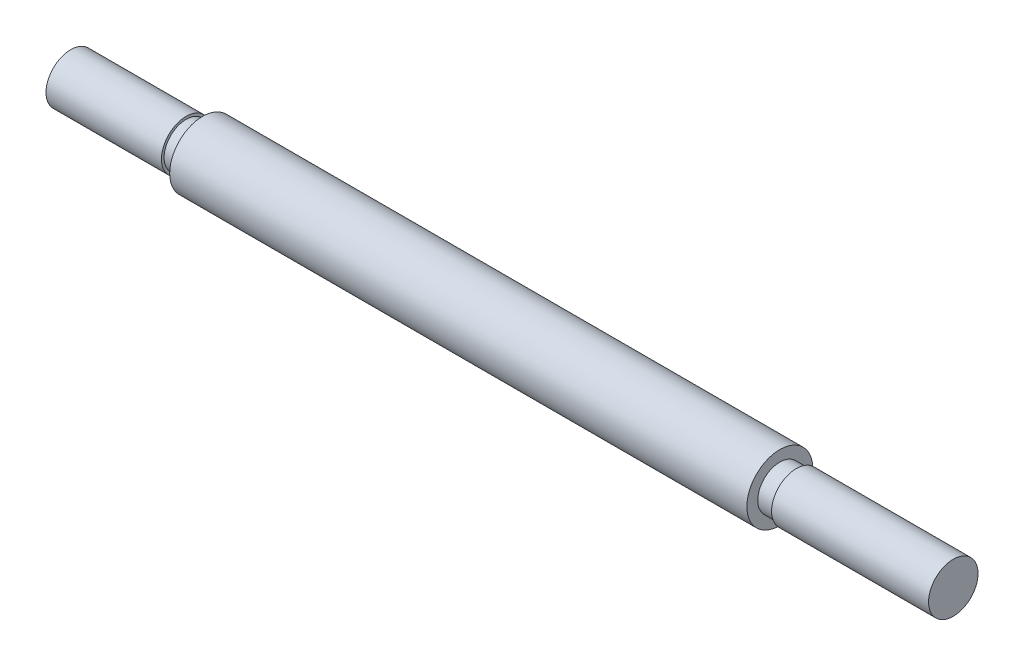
from build123d import *


with BuildPart() as part:
    # Sketch1 → Revolve1 (revolve)
    with BuildSketch(Plane(origin=(0, 0, 0), x_dir=(1, 0, 0), z_dir=(0, 1, 0)), mode=Mode.PRIVATE) as revolve1_sk:
        Polygon((0, 0), (0, 9.525), (44.45, 9.525), (44.45, 8.509), (50.8, 8.509), (50.8, 12.7), (273.05, 12.7), (273.05, 8.509), (279.4, 8.509), (279.4, 9.525), (339.852, 9.525), (339.852, 0), align=None)
    revolve(revolve1_sk.sketch.rotate(Axis((0, 0, 0), (1, 0, 0)), 180), axis=Axis((0, 0, 0), (1, 0, 0)))


solid = part.part
